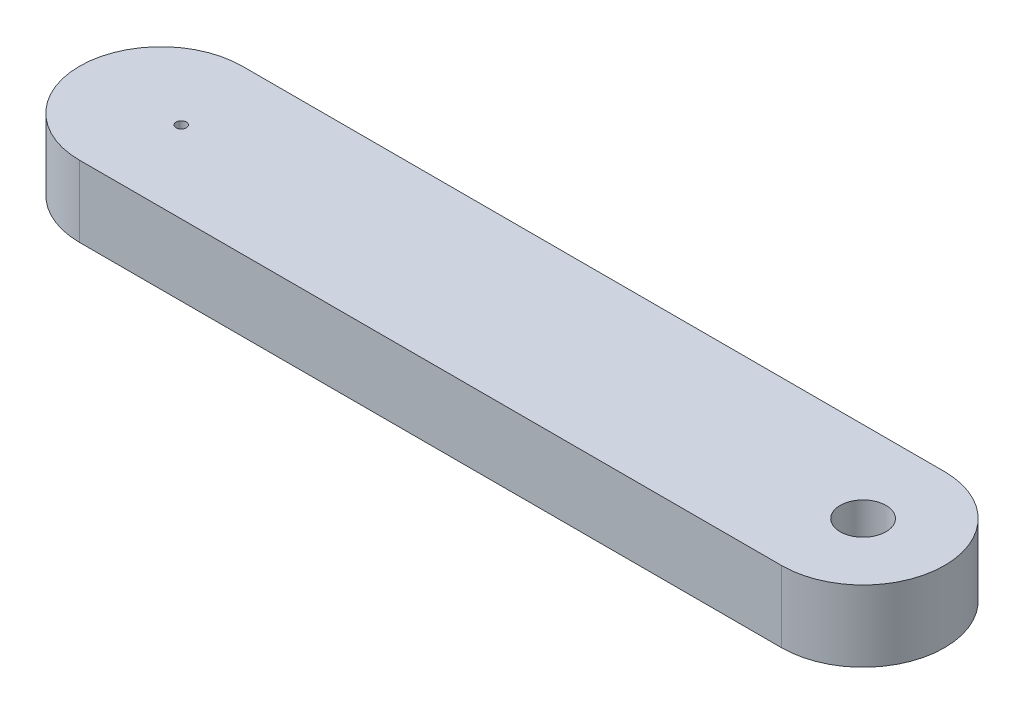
from build123d import *

# Parameters (mm, degrees)
SKETCH1_R           = 1.27
SKETCH1_R_2         = 5.715
BOSS_EXTRUDE2_DEPTH = 17.78


with BuildPart() as part:
    # Sketch1 → Boss-Extrude2 (new body)
    with BuildSketch(Plane(origin=(0, 0, 0), x_dir=(1, 0, 0), z_dir=(0, 1, 0))):
        with BuildLine():
            Line((-87.63, 20.32), (87.63, 20.32))
            ThreePointArc((87.63, 20.32), (107.95, 0), (87.63, -20.32))
            Line((87.63, -20.32), (-87.63, -20.32))
            ThreePointArc((-87.63, -20.32), (-107.95, 0), (-87.63, 20.32))
        make_face()
        with Locations(Location((-82.55, 0, 0), (0, 0, 270))):
            Circle(SKETCH1_R, mode=Mode.SUBTRACT)
        with Locations(Location((87.63, 0, 0), (0, 0, 270))):
            Circle(SKETCH1_R_2, mode=Mode.SUBTRACT)
    extrude(amount=BOSS_EXTRUDE2_DEPTH)


solid = part.part
